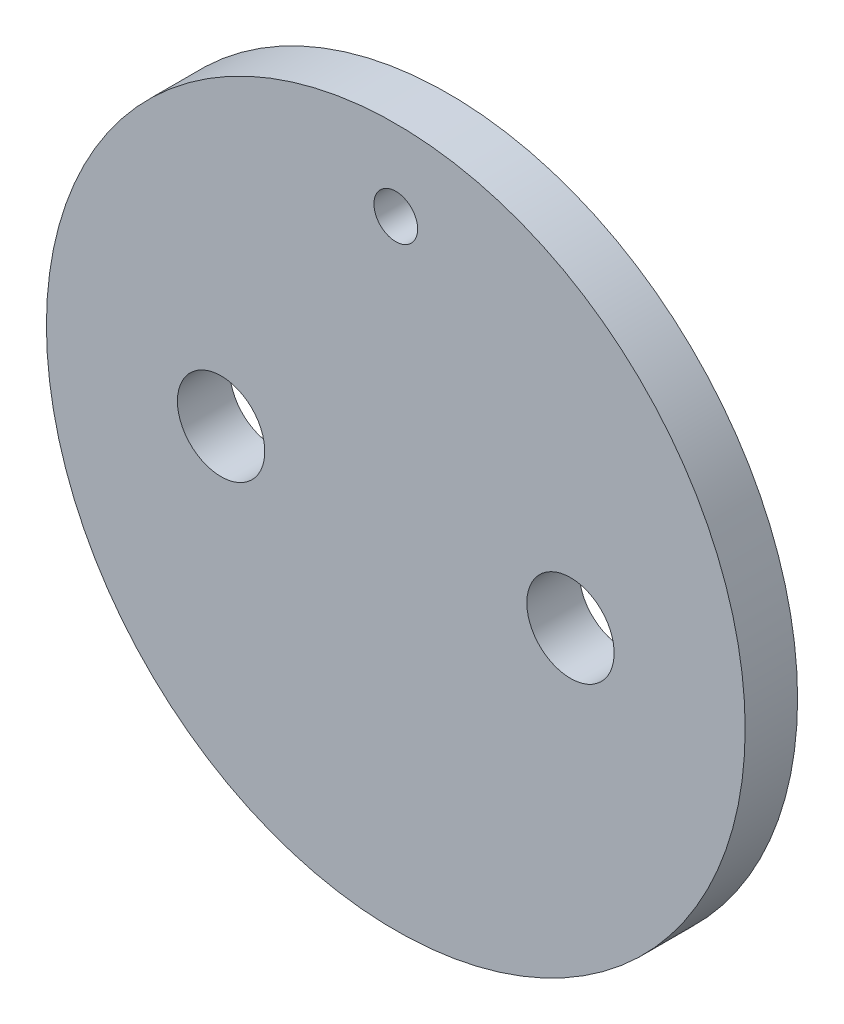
ISO-10303-21;
HEADER;
FILE_DESCRIPTION(('STEP AP214'),'2;1');
FILE_NAME('part.step','',(''),(''),'','','');
FILE_SCHEMA(('AUTOMOTIVE_DESIGN { 1 0 10303 214 1 1 1 1 }'));
ENDSEC;
DATA;
#1=APPLICATION_CONTEXT('core data for automotive mechanical design processes');
#2=APPLICATION_PROTOCOL_DEFINITION('international standard','automotive_design',2000,#1);
#3=PRODUCT_CONTEXT('',#1,'mechanical');
#4=PRODUCT('Part','Part','',(#3));
#5=PRODUCT_RELATED_PRODUCT_CATEGORY('part','',(#4));
#6=PRODUCT_DEFINITION_FORMATION('','',#4);
#7=PRODUCT_DEFINITION_CONTEXT('part definition',#1,'design');
#8=PRODUCT_DEFINITION('design','',#6,#7);
#9=PRODUCT_DEFINITION_SHAPE('','',#8);
#10=(LENGTH_UNIT() NAMED_UNIT(*) SI_UNIT(.MILLI.,.METRE.));
#11=(NAMED_UNIT(*) PLANE_ANGLE_UNIT() SI_UNIT($,.RADIAN.));
#12=(NAMED_UNIT(*) SI_UNIT($,.STERADIAN.) SOLID_ANGLE_UNIT());
#13=UNCERTAINTY_MEASURE_WITH_UNIT(LENGTH_MEASURE(1.E-05),#10,'distance_accuracy_value','');
#14=(GEOMETRIC_REPRESENTATION_CONTEXT(3) GLOBAL_UNCERTAINTY_ASSIGNED_CONTEXT((#13)) GLOBAL_UNIT_ASSIGNED_CONTEXT((#10,
#11,#12)) REPRESENTATION_CONTEXT('',''));
#15=CARTESIAN_POINT('',(0.,0.,0.));
#16=DIRECTION('',(0.,0.,1.));
#17=DIRECTION('',(1.,0.,0.));
#18=AXIS2_PLACEMENT_3D('',#15,#16,#17);
#19=CARTESIAN_POINT('',(0.,0.,3.81));
#20=DIRECTION('',(0.,0.,1.));
#21=DIRECTION('',(1.,0.,0.));
#22=AXIS2_PLACEMENT_3D('',#19,#20,#21);
#23=PLANE('',#22);
#24=CARTESIAN_POINT('',(12.7,0.,3.81));
#25=DIRECTION('',(0.,0.,1.));
#26=DIRECTION('',(1.,0.,0.));
#27=AXIS2_PLACEMENT_3D('',#24,#25,#26);
#28=CIRCLE('',#27,3.175);
#29=CARTESIAN_POINT('',(9.525,0.,3.81));
#30=VERTEX_POINT('',#29);
#31=EDGE_CURVE('E49',#30,#30,#28,.T.);
#32=ORIENTED_EDGE('',*,*,#31,.F.);
#33=EDGE_LOOP('',(#32));
#34=FACE_BOUND('',#33,.T.);
#35=CARTESIAN_POINT('',(0.,0.,3.81));
#36=DIRECTION('',(0.,0.,1.));
#37=DIRECTION('',(1.,0.,0.));
#38=AXIS2_PLACEMENT_3D('',#35,#36,#37);
#39=CIRCLE('',#38,25.4);
#40=CARTESIAN_POINT('',(-25.4,0.,3.81));
#41=VERTEX_POINT('',#40);
#42=EDGE_CURVE('E10',#41,#41,#39,.T.);
#43=ORIENTED_EDGE('',*,*,#42,.T.);
#44=EDGE_LOOP('',(#43));
#45=FACE_BOUND('',#44,.T.);
#46=CARTESIAN_POINT('',(0.,19.558,3.81));
#47=DIRECTION('',(0.,0.,1.));
#48=DIRECTION('',(1.,0.,0.));
#49=AXIS2_PLACEMENT_3D('',#46,#47,#48);
#50=CIRCLE('',#49,1.5875);
#51=CARTESIAN_POINT('',(-1.5875,19.558,3.81));
#52=VERTEX_POINT('',#51);
#53=EDGE_CURVE('E40',#52,#52,#50,.T.);
#54=ORIENTED_EDGE('',*,*,#53,.F.);
#55=EDGE_LOOP('',(#54));
#56=FACE_BOUND('',#55,.T.);
#57=CARTESIAN_POINT('',(-12.7,0.,3.81));
#58=DIRECTION('',(0.,0.,1.));
#59=DIRECTION('',(1.,0.,0.));
#60=AXIS2_PLACEMENT_3D('',#57,#58,#59);
#61=CIRCLE('',#60,3.175);
#62=CARTESIAN_POINT('',(-15.875,0.,3.81));
#63=VERTEX_POINT('',#62);
#64=EDGE_CURVE('E55',#63,#63,#61,.T.);
#65=ORIENTED_EDGE('',*,*,#64,.F.);
#66=EDGE_LOOP('',(#65));
#67=FACE_BOUND('',#66,.T.);
#68=ADVANCED_FACE('F29',(#34,#45,#56,#67),#23,.T.);
#69=CARTESIAN_POINT('',(0.,0.,0.));
#70=DIRECTION('',(0.,0.,1.));
#71=DIRECTION('',(1.,0.,0.));
#72=AXIS2_PLACEMENT_3D('',#69,#70,#71);
#73=PLANE('',#72);
#74=CARTESIAN_POINT('',(12.7,0.,0.));
#75=DIRECTION('',(0.,0.,1.));
#76=DIRECTION('',(1.,0.,0.));
#77=AXIS2_PLACEMENT_3D('',#74,#75,#76);
#78=CIRCLE('',#77,3.175);
#79=CARTESIAN_POINT('',(9.525,0.,0.));
#80=VERTEX_POINT('',#79);
#81=EDGE_CURVE('E52',#80,#80,#78,.T.);
#82=ORIENTED_EDGE('',*,*,#81,.T.);
#83=EDGE_LOOP('',(#82));
#84=FACE_BOUND('',#83,.T.);
#85=CARTESIAN_POINT('',(0.,0.,0.));
#86=DIRECTION('',(0.,0.,1.));
#87=DIRECTION('',(1.,0.,0.));
#88=AXIS2_PLACEMENT_3D('',#85,#86,#87);
#89=CIRCLE('',#88,25.4);
#90=CARTESIAN_POINT('',(-25.4,0.,0.));
#91=VERTEX_POINT('',#90);
#92=EDGE_CURVE('E36',#91,#91,#89,.T.);
#93=ORIENTED_EDGE('',*,*,#92,.F.);
#94=EDGE_LOOP('',(#93));
#95=FACE_BOUND('',#94,.T.);
#96=CARTESIAN_POINT('',(0.,19.558,0.));
#97=DIRECTION('',(0.,0.,1.));
#98=DIRECTION('',(1.,0.,0.));
#99=AXIS2_PLACEMENT_3D('',#96,#97,#98);
#100=CIRCLE('',#99,1.5875);
#101=CARTESIAN_POINT('',(-1.5875,19.558,0.));
#102=VERTEX_POINT('',#101);
#103=EDGE_CURVE('E44',#102,#102,#100,.T.);
#104=ORIENTED_EDGE('',*,*,#103,.T.);
#105=EDGE_LOOP('',(#104));
#106=FACE_BOUND('',#105,.T.);
#107=CARTESIAN_POINT('',(-12.7,0.,0.));
#108=DIRECTION('',(0.,0.,1.));
#109=DIRECTION('',(1.,0.,0.));
#110=AXIS2_PLACEMENT_3D('',#107,#108,#109);
#111=CIRCLE('',#110,3.175);
#112=CARTESIAN_POINT('',(-15.875,0.,0.));
#113=VERTEX_POINT('',#112);
#114=EDGE_CURVE('E58',#113,#113,#111,.T.);
#115=ORIENTED_EDGE('',*,*,#114,.T.);
#116=EDGE_LOOP('',(#115));
#117=FACE_BOUND('',#116,.T.);
#118=ADVANCED_FACE('F62',(#84,#95,#106,#117),#73,.F.);
#119=CARTESIAN_POINT('',(0.,0.,3.81));
#120=DIRECTION('',(0.,0.,-1.));
#121=DIRECTION('',(-1.,0.,0.));
#122=AXIS2_PLACEMENT_3D('',#119,#120,#121);
#123=CYLINDRICAL_SURFACE('',#122,25.4);
#124=CARTESIAN_POINT('',(-25.4,0.,3.81));
#125=CARTESIAN_POINT('',(-25.4,0.,3.7703125));
#126=CARTESIAN_POINT('',(-25.4,0.,3.730625));
#127=CARTESIAN_POINT('',(-25.4,0.,3.65125));
#128=CARTESIAN_POINT('',(-25.4,0.,3.6115625));
#129=CARTESIAN_POINT('',(-25.4,0.,3.5321875));
#130=CARTESIAN_POINT('',(-25.4,0.,3.4925));
#131=CARTESIAN_POINT('',(-25.4,0.,3.413125));
#132=CARTESIAN_POINT('',(-25.4,0.,3.3734375));
#133=CARTESIAN_POINT('',(-25.4,0.,3.2940625));
#134=CARTESIAN_POINT('',(-25.4,0.,3.254375));
#135=CARTESIAN_POINT('',(-25.4,0.,3.175));
#136=CARTESIAN_POINT('',(-25.4,0.,3.1353125));
#137=CARTESIAN_POINT('',(-25.4,0.,3.0559375));
#138=CARTESIAN_POINT('',(-25.4,0.,3.01625));
#139=CARTESIAN_POINT('',(-25.4,0.,2.936875));
#140=CARTESIAN_POINT('',(-25.4,0.,2.8971875));
#141=CARTESIAN_POINT('',(-25.4,0.,2.8178125));
#142=CARTESIAN_POINT('',(-25.4,0.,2.778125));
#143=CARTESIAN_POINT('',(-25.4,0.,2.69875));
#144=CARTESIAN_POINT('',(-25.4,0.,2.6590625));
#145=CARTESIAN_POINT('',(-25.4,0.,2.5796875));
#146=CARTESIAN_POINT('',(-25.4,0.,2.54));
#147=CARTESIAN_POINT('',(-25.4,0.,2.460625));
#148=CARTESIAN_POINT('',(-25.4,0.,2.4209375));
#149=CARTESIAN_POINT('',(-25.4,0.,2.3415625));
#150=CARTESIAN_POINT('',(-25.4,0.,2.301875));
#151=CARTESIAN_POINT('',(-25.4,0.,2.2225));
#152=CARTESIAN_POINT('',(-25.4,0.,2.1828125));
#153=CARTESIAN_POINT('',(-25.4,0.,2.1034375));
#154=CARTESIAN_POINT('',(-25.4,0.,2.06375));
#155=CARTESIAN_POINT('',(-25.4,0.,1.984375));
#156=CARTESIAN_POINT('',(-25.4,0.,1.9446875));
#157=CARTESIAN_POINT('',(-25.4,0.,1.8653125));
#158=CARTESIAN_POINT('',(-25.4,0.,1.825625));
#159=CARTESIAN_POINT('',(-25.4,0.,1.74625));
#160=CARTESIAN_POINT('',(-25.4,0.,1.7065625));
#161=CARTESIAN_POINT('',(-25.4,0.,1.6271875));
#162=CARTESIAN_POINT('',(-25.4,0.,1.5875));
#163=CARTESIAN_POINT('',(-25.4,0.,1.508125));
#164=CARTESIAN_POINT('',(-25.4,0.,1.4684375));
#165=CARTESIAN_POINT('',(-25.4,0.,1.3890625));
#166=CARTESIAN_POINT('',(-25.4,0.,1.349375));
#167=CARTESIAN_POINT('',(-25.4,0.,1.27));
#168=CARTESIAN_POINT('',(-25.4,0.,1.2303125));
#169=CARTESIAN_POINT('',(-25.4,0.,1.1509375));
#170=CARTESIAN_POINT('',(-25.4,0.,1.11125));
#171=CARTESIAN_POINT('',(-25.4,0.,1.031875));
#172=CARTESIAN_POINT('',(-25.4,0.,0.9921875));
#173=CARTESIAN_POINT('',(-25.4,0.,0.9128125));
#174=CARTESIAN_POINT('',(-25.4,0.,0.873125));
#175=CARTESIAN_POINT('',(-25.4,0.,0.79375));
#176=CARTESIAN_POINT('',(-25.4,0.,0.7540625));
#177=CARTESIAN_POINT('',(-25.4,0.,0.6746875));
#178=CARTESIAN_POINT('',(-25.4,0.,0.635));
#179=CARTESIAN_POINT('',(-25.4,0.,0.555625));
#180=CARTESIAN_POINT('',(-25.4,0.,0.5159375));
#181=CARTESIAN_POINT('',(-25.4,0.,0.4365625));
#182=CARTESIAN_POINT('',(-25.4,0.,0.396875));
#183=CARTESIAN_POINT('',(-25.4,0.,0.3175));
#184=CARTESIAN_POINT('',(-25.4,0.,0.2778125));
#185=CARTESIAN_POINT('',(-25.4,0.,0.1984375));
#186=CARTESIAN_POINT('',(-25.4,0.,0.15875));
#187=CARTESIAN_POINT('',(-25.4,0.,0.0793749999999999));
#188=CARTESIAN_POINT('',(-25.4,0.,0.0396874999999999));
#189=CARTESIAN_POINT('',(-25.4,0.,0.));
#190=B_SPLINE_CURVE_WITH_KNOTS('',3,(#124,#125,#126,#127,#128,#129,#130,#131,#132,#133,#134,
#135,#136,#137,#138,#139,#140,#141,#142,#143,#144,#145,#146,#147,#148,#149,#150,#151,#152,#153,
#154,#155,#156,#157,#158,#159,#160,#161,#162,#163,#164,#165,#166,#167,#168,#169,#170,#171,#172,
#173,#174,#175,#176,#177,#178,#179,#180,#181,#182,#183,#184,#185,#186,#187,#188,#189),
.UNSPECIFIED.,.F.,.F.,(4,2,2,2,2,2,2,2,2,2,2,2,2,2,2,2,2,2,2,2,2,2,2,2,2,2,2,2,2,2,2,2,4),(0.,
0.1190625,0.238125,0.3571875,0.47625,0.595312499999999,0.714375,0.833437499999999,
0.952499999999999,1.0715625,1.190625,1.3096875,1.42875,1.5478125,1.666875,1.7859375,1.905,
2.0240625,2.143125,2.2621875,2.38125,2.5003125,2.619375,2.7384375,2.8575,2.9765625,3.095625,
3.2146875,3.33375,3.4528125,3.571875,3.6909375,3.81),.UNSPECIFIED.);
#191=EDGE_CURVE('BSEAM31',#41,#91,#190,.T.);
#192=ORIENTED_EDGE('',*,*,#42,.F.);
#193=ORIENTED_EDGE('',*,*,#92,.T.);
#194=ORIENTED_EDGE('',*,*,#191,.T.);
#195=ORIENTED_EDGE('',*,*,#191,.F.);
#196=EDGE_LOOP('',(#192,#194,#193,#195));
#197=FACE_BOUND('',#196,.T.);
#198=ADVANCED_FACE('F31',(#197),#123,.T.);
#199=CARTESIAN_POINT('',(0.,19.558,3.81));
#200=DIRECTION('',(0.,0.,-1.));
#201=DIRECTION('',(-1.,0.,0.));
#202=AXIS2_PLACEMENT_3D('',#199,#200,#201);
#203=CYLINDRICAL_SURFACE('',#202,1.5875);
#204=CARTESIAN_POINT('',(-1.5875,19.558,3.81));
#205=CARTESIAN_POINT('',(-1.5875,19.558,3.7703125));
#206=CARTESIAN_POINT('',(-1.5875,19.558,3.730625));
#207=CARTESIAN_POINT('',(-1.5875,19.558,3.65125));
#208=CARTESIAN_POINT('',(-1.5875,19.558,3.6115625));
#209=CARTESIAN_POINT('',(-1.5875,19.558,3.5321875));
#210=CARTESIAN_POINT('',(-1.5875,19.558,3.4925));
#211=CARTESIAN_POINT('',(-1.5875,19.558,3.413125));
#212=CARTESIAN_POINT('',(-1.5875,19.558,3.3734375));
#213=CARTESIAN_POINT('',(-1.5875,19.558,3.2940625));
#214=CARTESIAN_POINT('',(-1.5875,19.558,3.254375));
#215=CARTESIAN_POINT('',(-1.5875,19.558,3.175));
#216=CARTESIAN_POINT('',(-1.5875,19.558,3.1353125));
#217=CARTESIAN_POINT('',(-1.5875,19.558,3.0559375));
#218=CARTESIAN_POINT('',(-1.5875,19.558,3.01625));
#219=CARTESIAN_POINT('',(-1.5875,19.558,2.936875));
#220=CARTESIAN_POINT('',(-1.5875,19.558,2.8971875));
#221=CARTESIAN_POINT('',(-1.5875,19.558,2.8178125));
#222=CARTESIAN_POINT('',(-1.5875,19.558,2.778125));
#223=CARTESIAN_POINT('',(-1.5875,19.558,2.69875));
#224=CARTESIAN_POINT('',(-1.5875,19.558,2.6590625));
#225=CARTESIAN_POINT('',(-1.5875,19.558,2.5796875));
#226=CARTESIAN_POINT('',(-1.5875,19.558,2.54));
#227=CARTESIAN_POINT('',(-1.5875,19.558,2.460625));
#228=CARTESIAN_POINT('',(-1.5875,19.558,2.4209375));
#229=CARTESIAN_POINT('',(-1.5875,19.558,2.3415625));
#230=CARTESIAN_POINT('',(-1.5875,19.558,2.301875));
#231=CARTESIAN_POINT('',(-1.5875,19.558,2.2225));
#232=CARTESIAN_POINT('',(-1.5875,19.558,2.1828125));
#233=CARTESIAN_POINT('',(-1.5875,19.558,2.1034375));
#234=CARTESIAN_POINT('',(-1.5875,19.558,2.06375));
#235=CARTESIAN_POINT('',(-1.5875,19.558,1.984375));
#236=CARTESIAN_POINT('',(-1.5875,19.558,1.9446875));
#237=CARTESIAN_POINT('',(-1.5875,19.558,1.8653125));
#238=CARTESIAN_POINT('',(-1.5875,19.558,1.825625));
#239=CARTESIAN_POINT('',(-1.5875,19.558,1.74625));
#240=CARTESIAN_POINT('',(-1.5875,19.558,1.7065625));
#241=CARTESIAN_POINT('',(-1.5875,19.558,1.6271875));
#242=CARTESIAN_POINT('',(-1.5875,19.558,1.5875));
#243=CARTESIAN_POINT('',(-1.5875,19.558,1.508125));
#244=CARTESIAN_POINT('',(-1.5875,19.558,1.4684375));
#245=CARTESIAN_POINT('',(-1.5875,19.558,1.3890625));
#246=CARTESIAN_POINT('',(-1.5875,19.558,1.349375));
#247=CARTESIAN_POINT('',(-1.5875,19.558,1.27));
#248=CARTESIAN_POINT('',(-1.5875,19.558,1.2303125));
#249=CARTESIAN_POINT('',(-1.5875,19.558,1.1509375));
#250=CARTESIAN_POINT('',(-1.5875,19.558,1.11125));
#251=CARTESIAN_POINT('',(-1.5875,19.558,1.031875));
#252=CARTESIAN_POINT('',(-1.5875,19.558,0.9921875));
#253=CARTESIAN_POINT('',(-1.5875,19.558,0.9128125));
#254=CARTESIAN_POINT('',(-1.5875,19.558,0.873125));
#255=CARTESIAN_POINT('',(-1.5875,19.558,0.79375));
#256=CARTESIAN_POINT('',(-1.5875,19.558,0.7540625));
#257=CARTESIAN_POINT('',(-1.5875,19.558,0.6746875));
#258=CARTESIAN_POINT('',(-1.5875,19.558,0.635));
#259=CARTESIAN_POINT('',(-1.5875,19.558,0.555625));
#260=CARTESIAN_POINT('',(-1.5875,19.558,0.5159375));
#261=CARTESIAN_POINT('',(-1.5875,19.558,0.4365625));
#262=CARTESIAN_POINT('',(-1.5875,19.558,0.396875));
#263=CARTESIAN_POINT('',(-1.5875,19.558,0.3175));
#264=CARTESIAN_POINT('',(-1.5875,19.558,0.2778125));
#265=CARTESIAN_POINT('',(-1.5875,19.558,0.1984375));
#266=CARTESIAN_POINT('',(-1.5875,19.558,0.15875));
#267=CARTESIAN_POINT('',(-1.5875,19.558,0.0793749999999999));
#268=CARTESIAN_POINT('',(-1.5875,19.558,0.0396874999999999));
#269=CARTESIAN_POINT('',(-1.5875,19.558,0.));
#270=B_SPLINE_CURVE_WITH_KNOTS('',3,(#204,#205,#206,#207,#208,#209,#210,#211,#212,#213,#214,
#215,#216,#217,#218,#219,#220,#221,#222,#223,#224,#225,#226,#227,#228,#229,#230,#231,#232,#233,
#234,#235,#236,#237,#238,#239,#240,#241,#242,#243,#244,#245,#246,#247,#248,#249,#250,#251,#252,
#253,#254,#255,#256,#257,#258,#259,#260,#261,#262,#263,#264,#265,#266,#267,#268,#269),
.UNSPECIFIED.,.F.,.F.,(4,2,2,2,2,2,2,2,2,2,2,2,2,2,2,2,2,2,2,2,2,2,2,2,2,2,2,2,2,2,2,2,4),(0.,
0.1190625,0.238125,0.3571875,0.47625,0.5953125,0.714375,0.8334375,0.9525,1.0715625,1.190625,
1.3096875,1.42875,1.5478125,1.666875,1.7859375,1.905,2.0240625,2.143125,2.2621875,2.38125,
2.5003125,2.619375,2.7384375,2.8575,2.9765625,3.095625,3.2146875,3.33375,3.4528125,3.571875,
3.6909375,3.81),.UNSPECIFIED.);
#271=EDGE_CURVE('BSEAM72',#52,#102,#270,.T.);
#272=ORIENTED_EDGE('',*,*,#53,.T.);
#273=ORIENTED_EDGE('',*,*,#103,.F.);
#274=ORIENTED_EDGE('',*,*,#271,.T.);
#275=ORIENTED_EDGE('',*,*,#271,.F.);
#276=EDGE_LOOP('',(#272,#274,#273,#275));
#277=FACE_BOUND('',#276,.T.);
#278=ADVANCED_FACE('F72',(#277),#203,.F.);
#279=CARTESIAN_POINT('',(12.7,0.,3.81));
#280=DIRECTION('',(0.,0.,-1.));
#281=DIRECTION('',(-1.,0.,0.));
#282=AXIS2_PLACEMENT_3D('',#279,#280,#281);
#283=CYLINDRICAL_SURFACE('',#282,3.175);
#284=CARTESIAN_POINT('',(9.525,0.,3.81));
#285=CARTESIAN_POINT('',(9.525,0.,3.7703125));
#286=CARTESIAN_POINT('',(9.525,0.,3.730625));
#287=CARTESIAN_POINT('',(9.525,0.,3.65125));
#288=CARTESIAN_POINT('',(9.525,0.,3.6115625));
#289=CARTESIAN_POINT('',(9.525,0.,3.5321875));
#290=CARTESIAN_POINT('',(9.525,0.,3.4925));
#291=CARTESIAN_POINT('',(9.525,0.,3.413125));
#292=CARTESIAN_POINT('',(9.525,0.,3.3734375));
#293=CARTESIAN_POINT('',(9.525,0.,3.2940625));
#294=CARTESIAN_POINT('',(9.525,0.,3.254375));
#295=CARTESIAN_POINT('',(9.525,0.,3.175));
#296=CARTESIAN_POINT('',(9.525,0.,3.1353125));
#297=CARTESIAN_POINT('',(9.525,0.,3.0559375));
#298=CARTESIAN_POINT('',(9.525,0.,3.01625));
#299=CARTESIAN_POINT('',(9.525,0.,2.936875));
#300=CARTESIAN_POINT('',(9.525,0.,2.8971875));
#301=CARTESIAN_POINT('',(9.525,0.,2.8178125));
#302=CARTESIAN_POINT('',(9.525,0.,2.778125));
#303=CARTESIAN_POINT('',(9.525,0.,2.69875));
#304=CARTESIAN_POINT('',(9.525,0.,2.6590625));
#305=CARTESIAN_POINT('',(9.525,0.,2.5796875));
#306=CARTESIAN_POINT('',(9.525,0.,2.54));
#307=CARTESIAN_POINT('',(9.525,0.,2.460625));
#308=CARTESIAN_POINT('',(9.525,0.,2.4209375));
#309=CARTESIAN_POINT('',(9.525,0.,2.3415625));
#310=CARTESIAN_POINT('',(9.525,0.,2.301875));
#311=CARTESIAN_POINT('',(9.525,0.,2.2225));
#312=CARTESIAN_POINT('',(9.525,0.,2.1828125));
#313=CARTESIAN_POINT('',(9.525,0.,2.1034375));
#314=CARTESIAN_POINT('',(9.525,0.,2.06375));
#315=CARTESIAN_POINT('',(9.525,0.,1.984375));
#316=CARTESIAN_POINT('',(9.525,0.,1.9446875));
#317=CARTESIAN_POINT('',(9.525,0.,1.8653125));
#318=CARTESIAN_POINT('',(9.525,0.,1.825625));
#319=CARTESIAN_POINT('',(9.525,0.,1.74625));
#320=CARTESIAN_POINT('',(9.525,0.,1.7065625));
#321=CARTESIAN_POINT('',(9.525,0.,1.6271875));
#322=CARTESIAN_POINT('',(9.525,0.,1.5875));
#323=CARTESIAN_POINT('',(9.525,0.,1.508125));
#324=CARTESIAN_POINT('',(9.525,0.,1.4684375));
#325=CARTESIAN_POINT('',(9.525,0.,1.3890625));
#326=CARTESIAN_POINT('',(9.525,0.,1.349375));
#327=CARTESIAN_POINT('',(9.525,0.,1.27));
#328=CARTESIAN_POINT('',(9.525,0.,1.2303125));
#329=CARTESIAN_POINT('',(9.525,0.,1.1509375));
#330=CARTESIAN_POINT('',(9.525,0.,1.11125));
#331=CARTESIAN_POINT('',(9.525,0.,1.031875));
#332=CARTESIAN_POINT('',(9.525,0.,0.9921875));
#333=CARTESIAN_POINT('',(9.525,0.,0.9128125));
#334=CARTESIAN_POINT('',(9.525,0.,0.873125));
#335=CARTESIAN_POINT('',(9.525,0.,0.79375));
#336=CARTESIAN_POINT('',(9.525,0.,0.7540625));
#337=CARTESIAN_POINT('',(9.525,0.,0.6746875));
#338=CARTESIAN_POINT('',(9.525,0.,0.635));
#339=CARTESIAN_POINT('',(9.525,0.,0.555625));
#340=CARTESIAN_POINT('',(9.525,0.,0.5159375));
#341=CARTESIAN_POINT('',(9.525,0.,0.4365625));
#342=CARTESIAN_POINT('',(9.525,0.,0.396875));
#343=CARTESIAN_POINT('',(9.525,0.,0.3175));
#344=CARTESIAN_POINT('',(9.525,0.,0.2778125));
#345=CARTESIAN_POINT('',(9.525,0.,0.1984375));
#346=CARTESIAN_POINT('',(9.525,0.,0.15875));
#347=CARTESIAN_POINT('',(9.525,0.,0.0793749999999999));
#348=CARTESIAN_POINT('',(9.525,0.,0.0396874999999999));
#349=CARTESIAN_POINT('',(9.525,0.,0.));
#350=B_SPLINE_CURVE_WITH_KNOTS('',3,(#284,#285,#286,#287,#288,#289,#290,#291,#292,#293,#294,
#295,#296,#297,#298,#299,#300,#301,#302,#303,#304,#305,#306,#307,#308,#309,#310,#311,#312,#313,
#314,#315,#316,#317,#318,#319,#320,#321,#322,#323,#324,#325,#326,#327,#328,#329,#330,#331,#332,
#333,#334,#335,#336,#337,#338,#339,#340,#341,#342,#343,#344,#345,#346,#347,#348,#349),
.UNSPECIFIED.,.F.,.F.,(4,2,2,2,2,2,2,2,2,2,2,2,2,2,2,2,2,2,2,2,2,2,2,2,2,2,2,2,2,2,2,2,4),(0.,
0.1190625,0.238125,0.3571875,0.47625,0.595312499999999,0.714375,0.833437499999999,
0.952499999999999,1.0715625,1.190625,1.3096875,1.42875,1.5478125,1.666875,1.7859375,1.905,
2.0240625,2.143125,2.2621875,2.38125,2.5003125,2.619375,2.7384375,2.8575,2.9765625,3.095625,
3.2146875,3.33375,3.4528125,3.571875,3.6909375,3.81),.UNSPECIFIED.);
#351=EDGE_CURVE('BSEAM66',#30,#80,#350,.T.);
#352=ORIENTED_EDGE('',*,*,#31,.T.);
#353=ORIENTED_EDGE('',*,*,#81,.F.);
#354=ORIENTED_EDGE('',*,*,#351,.T.);
#355=ORIENTED_EDGE('',*,*,#351,.F.);
#356=EDGE_LOOP('',(#352,#354,#353,#355));
#357=FACE_BOUND('',#356,.T.);
#358=ADVANCED_FACE('F66',(#357),#283,.F.);
#359=CARTESIAN_POINT('',(-12.7,0.,3.81));
#360=DIRECTION('',(0.,0.,-1.));
#361=DIRECTION('',(-1.,0.,0.));
#362=AXIS2_PLACEMENT_3D('',#359,#360,#361);
#363=CYLINDRICAL_SURFACE('',#362,3.175);
#364=CARTESIAN_POINT('',(-15.875,0.,3.81));
#365=CARTESIAN_POINT('',(-15.875,0.,3.7703125));
#366=CARTESIAN_POINT('',(-15.875,0.,3.730625));
#367=CARTESIAN_POINT('',(-15.875,0.,3.65125));
#368=CARTESIAN_POINT('',(-15.875,0.,3.6115625));
#369=CARTESIAN_POINT('',(-15.875,0.,3.5321875));
#370=CARTESIAN_POINT('',(-15.875,0.,3.4925));
#371=CARTESIAN_POINT('',(-15.875,0.,3.413125));
#372=CARTESIAN_POINT('',(-15.875,0.,3.3734375));
#373=CARTESIAN_POINT('',(-15.875,0.,3.2940625));
#374=CARTESIAN_POINT('',(-15.875,0.,3.254375));
#375=CARTESIAN_POINT('',(-15.875,0.,3.175));
#376=CARTESIAN_POINT('',(-15.875,0.,3.1353125));
#377=CARTESIAN_POINT('',(-15.875,0.,3.0559375));
#378=CARTESIAN_POINT('',(-15.875,0.,3.01625));
#379=CARTESIAN_POINT('',(-15.875,0.,2.936875));
#380=CARTESIAN_POINT('',(-15.875,0.,2.8971875));
#381=CARTESIAN_POINT('',(-15.875,0.,2.8178125));
#382=CARTESIAN_POINT('',(-15.875,0.,2.778125));
#383=CARTESIAN_POINT('',(-15.875,0.,2.69875));
#384=CARTESIAN_POINT('',(-15.875,0.,2.6590625));
#385=CARTESIAN_POINT('',(-15.875,0.,2.5796875));
#386=CARTESIAN_POINT('',(-15.875,0.,2.54));
#387=CARTESIAN_POINT('',(-15.875,0.,2.460625));
#388=CARTESIAN_POINT('',(-15.875,0.,2.4209375));
#389=CARTESIAN_POINT('',(-15.875,0.,2.3415625));
#390=CARTESIAN_POINT('',(-15.875,0.,2.301875));
#391=CARTESIAN_POINT('',(-15.875,0.,2.2225));
#392=CARTESIAN_POINT('',(-15.875,0.,2.1828125));
#393=CARTESIAN_POINT('',(-15.875,0.,2.1034375));
#394=CARTESIAN_POINT('',(-15.875,0.,2.06375));
#395=CARTESIAN_POINT('',(-15.875,0.,1.984375));
#396=CARTESIAN_POINT('',(-15.875,0.,1.9446875));
#397=CARTESIAN_POINT('',(-15.875,0.,1.8653125));
#398=CARTESIAN_POINT('',(-15.875,0.,1.825625));
#399=CARTESIAN_POINT('',(-15.875,0.,1.74625));
#400=CARTESIAN_POINT('',(-15.875,0.,1.7065625));
#401=CARTESIAN_POINT('',(-15.875,0.,1.6271875));
#402=CARTESIAN_POINT('',(-15.875,0.,1.5875));
#403=CARTESIAN_POINT('',(-15.875,0.,1.508125));
#404=CARTESIAN_POINT('',(-15.875,0.,1.4684375));
#405=CARTESIAN_POINT('',(-15.875,0.,1.3890625));
#406=CARTESIAN_POINT('',(-15.875,0.,1.349375));
#407=CARTESIAN_POINT('',(-15.875,0.,1.27));
#408=CARTESIAN_POINT('',(-15.875,0.,1.2303125));
#409=CARTESIAN_POINT('',(-15.875,0.,1.1509375));
#410=CARTESIAN_POINT('',(-15.875,0.,1.11125));
#411=CARTESIAN_POINT('',(-15.875,0.,1.031875));
#412=CARTESIAN_POINT('',(-15.875,0.,0.9921875));
#413=CARTESIAN_POINT('',(-15.875,0.,0.9128125));
#414=CARTESIAN_POINT('',(-15.875,0.,0.873125));
#415=CARTESIAN_POINT('',(-15.875,0.,0.79375));
#416=CARTESIAN_POINT('',(-15.875,0.,0.7540625));
#417=CARTESIAN_POINT('',(-15.875,0.,0.6746875));
#418=CARTESIAN_POINT('',(-15.875,0.,0.635));
#419=CARTESIAN_POINT('',(-15.875,0.,0.555625));
#420=CARTESIAN_POINT('',(-15.875,0.,0.5159375));
#421=CARTESIAN_POINT('',(-15.875,0.,0.4365625));
#422=CARTESIAN_POINT('',(-15.875,0.,0.396875));
#423=CARTESIAN_POINT('',(-15.875,0.,0.3175));
#424=CARTESIAN_POINT('',(-15.875,0.,0.2778125));
#425=CARTESIAN_POINT('',(-15.875,0.,0.1984375));
#426=CARTESIAN_POINT('',(-15.875,0.,0.15875));
#427=CARTESIAN_POINT('',(-15.875,0.,0.0793749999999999));
#428=CARTESIAN_POINT('',(-15.875,0.,0.0396874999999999));
#429=CARTESIAN_POINT('',(-15.875,0.,0.));
#430=B_SPLINE_CURVE_WITH_KNOTS('',3,(#364,#365,#366,#367,#368,#369,#370,#371,#372,#373,#374,
#375,#376,#377,#378,#379,#380,#381,#382,#383,#384,#385,#386,#387,#388,#389,#390,#391,#392,#393,
#394,#395,#396,#397,#398,#399,#400,#401,#402,#403,#404,#405,#406,#407,#408,#409,#410,#411,#412,
#413,#414,#415,#416,#417,#418,#419,#420,#421,#422,#423,#424,#425,#426,#427,#428,#429),
.UNSPECIFIED.,.F.,.F.,(4,2,2,2,2,2,2,2,2,2,2,2,2,2,2,2,2,2,2,2,2,2,2,2,2,2,2,2,2,2,2,2,4),(0.,
0.1190625,0.238125,0.3571875,0.47625,0.595312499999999,0.714375,0.833437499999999,
0.952499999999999,1.0715625,1.190625,1.3096875,1.42875,1.5478125,1.666875,1.7859375,1.905,
2.0240625,2.143125,2.2621875,2.38125,2.5003125,2.619375,2.7384375,2.8575,2.9765625,3.095625,
3.2146875,3.33375,3.4528125,3.571875,3.6909375,3.81),.UNSPECIFIED.);
#431=EDGE_CURVE('BSEAM64',#63,#113,#430,.T.);
#432=ORIENTED_EDGE('',*,*,#64,.T.);
#433=ORIENTED_EDGE('',*,*,#114,.F.);
#434=ORIENTED_EDGE('',*,*,#431,.T.);
#435=ORIENTED_EDGE('',*,*,#431,.F.);
#436=EDGE_LOOP('',(#432,#434,#433,#435));
#437=FACE_BOUND('',#436,.T.);
#438=ADVANCED_FACE('F64',(#437),#363,.F.);
#439=CLOSED_SHELL('',(#68,#118,#198,#278,#358,#438));
#440=MANIFOLD_SOLID_BREP('B2',#439);
#441=ADVANCED_BREP_SHAPE_REPRESENTATION('',(#18,#440),#14);
#442=SHAPE_DEFINITION_REPRESENTATION(#9,#441);
ENDSEC;
END-ISO-10303-21;
